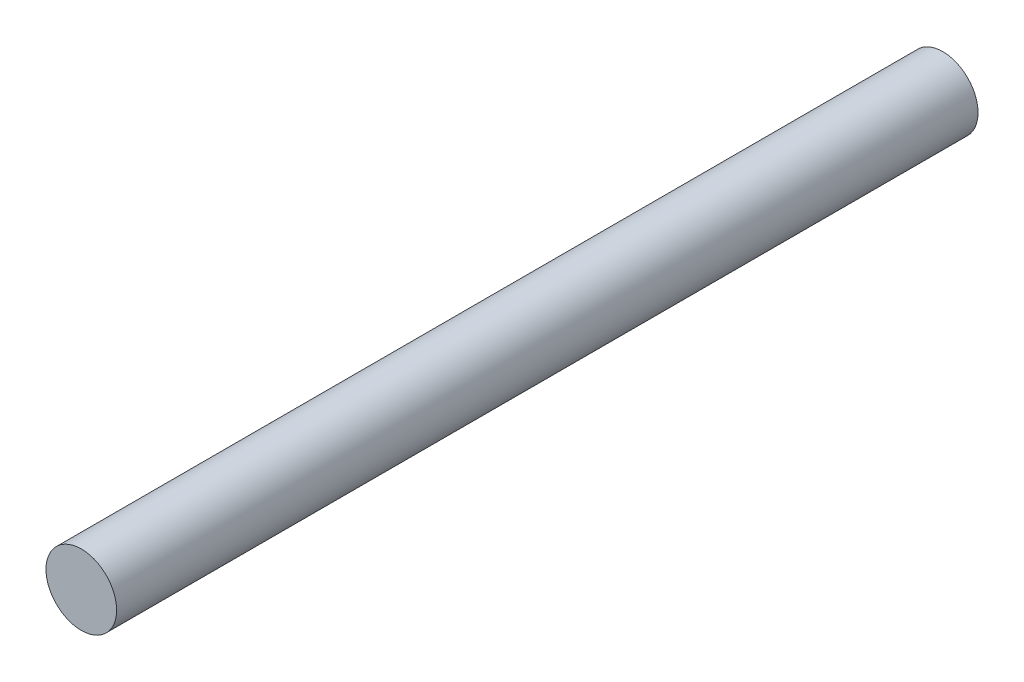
ISO-10303-21;
HEADER;
FILE_DESCRIPTION(('STEP AP214'),'2;1');
FILE_NAME('part.step','',(''),(''),'','','');
FILE_SCHEMA(('AUTOMOTIVE_DESIGN { 1 0 10303 214 1 1 1 1 }'));
ENDSEC;
DATA;
#1=APPLICATION_CONTEXT('core data for automotive mechanical design processes');
#2=APPLICATION_PROTOCOL_DEFINITION('international standard','automotive_design',2000,#1);
#3=PRODUCT_CONTEXT('',#1,'mechanical');
#4=PRODUCT('Part','Part','',(#3));
#5=PRODUCT_RELATED_PRODUCT_CATEGORY('part','',(#4));
#6=PRODUCT_DEFINITION_FORMATION('','',#4);
#7=PRODUCT_DEFINITION_CONTEXT('part definition',#1,'design');
#8=PRODUCT_DEFINITION('design','',#6,#7);
#9=PRODUCT_DEFINITION_SHAPE('','',#8);
#10=(LENGTH_UNIT() NAMED_UNIT(*) SI_UNIT(.MILLI.,.METRE.));
#11=(NAMED_UNIT(*) PLANE_ANGLE_UNIT() SI_UNIT($,.RADIAN.));
#12=(NAMED_UNIT(*) SI_UNIT($,.STERADIAN.) SOLID_ANGLE_UNIT());
#13=UNCERTAINTY_MEASURE_WITH_UNIT(LENGTH_MEASURE(1.E-05),#10,'distance_accuracy_value','');
#14=(GEOMETRIC_REPRESENTATION_CONTEXT(3) GLOBAL_UNCERTAINTY_ASSIGNED_CONTEXT((#13)) GLOBAL_UNIT_ASSIGNED_CONTEXT((#10,
#11,#12)) REPRESENTATION_CONTEXT('',''));
#15=CARTESIAN_POINT('',(0.,0.,0.));
#16=DIRECTION('',(0.,0.,1.));
#17=DIRECTION('',(1.,0.,0.));
#18=AXIS2_PLACEMENT_3D('',#15,#16,#17);
#19=CARTESIAN_POINT('',(-1.265,-1.265,0.));
#20=DIRECTION('',(0.,0.,1.));
#21=DIRECTION('',(1.,0.,0.));
#22=AXIS2_PLACEMENT_3D('',#19,#20,#21);
#23=PLANE('',#22);
#24=CARTESIAN_POINT('',(0.,0.,0.));
#25=DIRECTION('',(0.,0.,-1.));
#26=DIRECTION('',(-1.,0.,0.));
#27=AXIS2_PLACEMENT_3D('',#24,#25,#26);
#28=CIRCLE('',#27,1.25);
#29=CARTESIAN_POINT('',(-1.25,0.,0.));
#30=VERTEX_POINT('',#29);
#31=EDGE_CURVE('E8',#30,#30,#28,.T.);
#32=ORIENTED_EDGE('',*,*,#31,.T.);
#33=EDGE_LOOP('',(#32));
#34=FACE_BOUND('',#33,.T.);
#35=ADVANCED_FACE('F12',(#34),#23,.F.);
#36=CARTESIAN_POINT('',(0.,0.,29.));
#37=DIRECTION('',(0.,0.,-1.));
#38=DIRECTION('',(-1.,0.,0.));
#39=AXIS2_PLACEMENT_3D('',#36,#37,#38);
#40=CYLINDRICAL_SURFACE('',#39,1.25);
#41=ORIENTED_EDGE('',*,*,#31,.F.);
#42=EDGE_LOOP('',(#41));
#43=FACE_BOUND('',#42,.T.);
#44=CARTESIAN_POINT('',(0.,0.,30.5));
#45=DIRECTION('',(0.,0.,1.));
#46=DIRECTION('',(1.,0.,0.));
#47=AXIS2_PLACEMENT_3D('',#44,#45,#46);
#48=CIRCLE('',#47,1.25);
#49=CARTESIAN_POINT('',(1.25,0.,30.5));
#50=VERTEX_POINT('',#49);
#51=EDGE_CURVE('E18',#50,#50,#48,.T.);
#52=ORIENTED_EDGE('',*,*,#51,.F.);
#53=EDGE_LOOP('',(#52));
#54=FACE_BOUND('',#53,.T.);
#55=ADVANCED_FACE('F26',(#43,#54),#40,.T.);
#56=CARTESIAN_POINT('',(0.,0.,30.5));
#57=DIRECTION('',(0.,0.,1.));
#58=DIRECTION('',(1.,0.,0.));
#59=AXIS2_PLACEMENT_3D('',#56,#57,#58);
#60=PLANE('',#59);
#61=ORIENTED_EDGE('',*,*,#51,.T.);
#62=EDGE_LOOP('',(#61));
#63=FACE_BOUND('',#62,.T.);
#64=ADVANCED_FACE('F24',(#63),#60,.T.);
#65=CLOSED_SHELL('',(#35,#55,#64));
#66=MANIFOLD_SOLID_BREP('B1',#65);
#67=ADVANCED_BREP_SHAPE_REPRESENTATION('',(#18,#66),#14);
#68=SHAPE_DEFINITION_REPRESENTATION(#9,#67);
ENDSEC;
END-ISO-10303-21;
